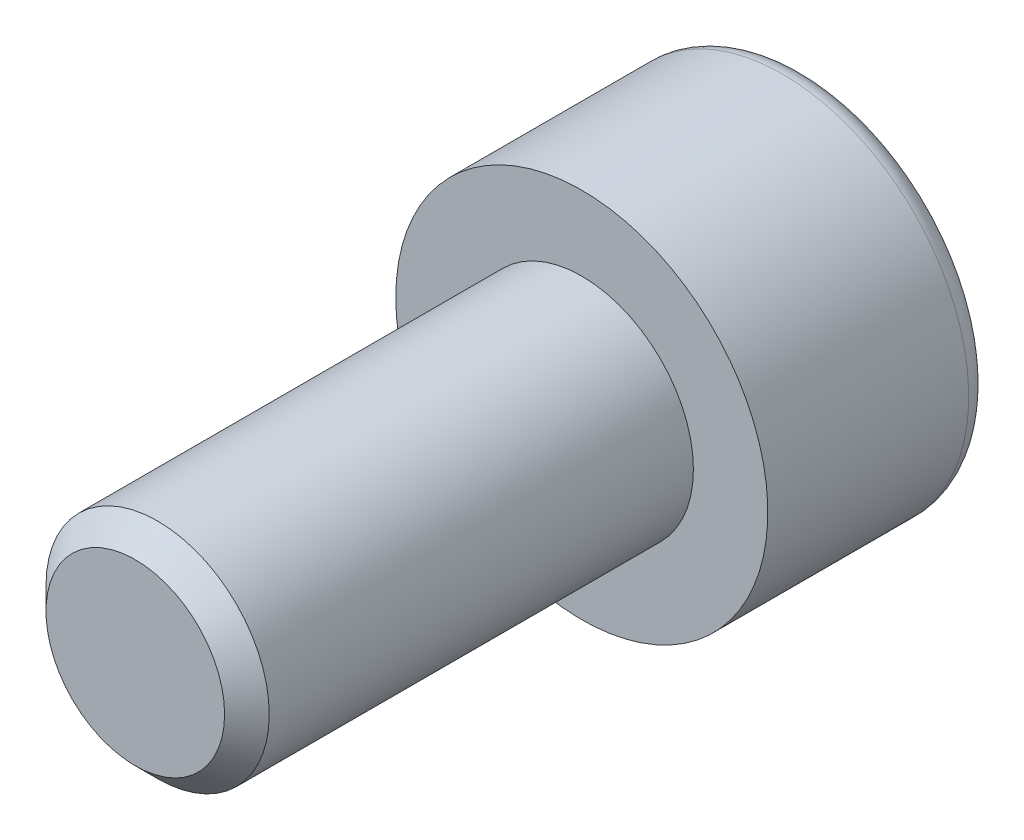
ISO-10303-21;
HEADER;
FILE_DESCRIPTION(('STEP AP214'),'2;1');
FILE_NAME('part.step','',(''),(''),'','','');
FILE_SCHEMA(('AUTOMOTIVE_DESIGN { 1 0 10303 214 1 1 1 1 }'));
ENDSEC;
DATA;
#1=APPLICATION_CONTEXT('core data for automotive mechanical design processes');
#2=APPLICATION_PROTOCOL_DEFINITION('international standard','automotive_design',2000,#1);
#3=PRODUCT_CONTEXT('',#1,'mechanical');
#4=PRODUCT('Part','Part','',(#3));
#5=PRODUCT_RELATED_PRODUCT_CATEGORY('part','',(#4));
#6=PRODUCT_DEFINITION_FORMATION('','',#4);
#7=PRODUCT_DEFINITION_CONTEXT('part definition',#1,'design');
#8=PRODUCT_DEFINITION('design','',#6,#7);
#9=PRODUCT_DEFINITION_SHAPE('','',#8);
#10=(LENGTH_UNIT() NAMED_UNIT(*) SI_UNIT(.MILLI.,.METRE.));
#11=(NAMED_UNIT(*) PLANE_ANGLE_UNIT() SI_UNIT($,.RADIAN.));
#12=(NAMED_UNIT(*) SI_UNIT($,.STERADIAN.) SOLID_ANGLE_UNIT());
#13=UNCERTAINTY_MEASURE_WITH_UNIT(LENGTH_MEASURE(1.E-05),#10,'distance_accuracy_value','');
#14=(GEOMETRIC_REPRESENTATION_CONTEXT(3) GLOBAL_UNCERTAINTY_ASSIGNED_CONTEXT((#13)) GLOBAL_UNIT_ASSIGNED_CONTEXT((#10,
#11,#12)) REPRESENTATION_CONTEXT('',''));
#15=CARTESIAN_POINT('',(0.,0.,0.));
#16=DIRECTION('',(0.,0.,1.));
#17=DIRECTION('',(1.,0.,0.));
#18=AXIS2_PLACEMENT_3D('',#15,#16,#17);
#19=CARTESIAN_POINT('',(0.,0.,-6.));
#20=DIRECTION('',(0.,0.,1.));
#21=DIRECTION('',(1.,0.,0.));
#22=AXIS2_PLACEMENT_3D('',#19,#20,#21);
#23=PLANE('',#22);
#24=CARTESIAN_POINT('',(0.,0.,-6.));
#25=DIRECTION('',(0.,0.,-1.));
#26=DIRECTION('',(-1.,0.,0.));
#27=AXIS2_PLACEMENT_3D('',#24,#25,#26);
#28=CIRCLE('',#27,4.4);
#29=CARTESIAN_POINT('',(-4.4,0.,-6.));
#30=VERTEX_POINT('',#29);
#31=EDGE_CURVE('E141',#30,#30,#28,.T.);
#32=ORIENTED_EDGE('',*,*,#31,.T.);
#33=EDGE_LOOP('',(#32));
#34=FACE_BOUND('',#33,.T.);
#35=DIRECTION('',(-0.86602540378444,0.499999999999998,0.));
#36=VECTOR('',#35,1.);
#37=CARTESIAN_POINT('',(0.,2.88675134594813,-6.));
#38=LINE('',#37,#36);
#39=CARTESIAN_POINT('',(2.5,1.44337567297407,-6.));
#40=VERTEX_POINT('',#39);
#41=CARTESIAN_POINT('',(0.,2.88675134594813,-6.));
#42=VERTEX_POINT('',#41);
#43=EDGE_CURVE('E45',#40,#42,#38,.T.);
#44=ORIENTED_EDGE('',*,*,#43,.T.);
#45=DIRECTION('',(-0.866025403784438,-0.500000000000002,0.));
#46=VECTOR('',#45,1.);
#47=CARTESIAN_POINT('',(0.,2.88675134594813,-6.));
#48=LINE('',#47,#46);
#49=CARTESIAN_POINT('',(-2.5,1.44337567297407,-6.));
#50=VERTEX_POINT('',#49);
#51=EDGE_CURVE('E85',#42,#50,#48,.T.);
#52=ORIENTED_EDGE('',*,*,#51,.T.);
#53=DIRECTION('',(0.,-1.,0.));
#54=VECTOR('',#53,1.);
#55=CARTESIAN_POINT('',(-2.5,-1.44337567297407,-6.));
#56=LINE('',#55,#54);
#57=CARTESIAN_POINT('',(-2.5,-1.44337567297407,-6.));
#58=VERTEX_POINT('',#57);
#59=EDGE_CURVE('E93',#50,#58,#56,.T.);
#60=ORIENTED_EDGE('',*,*,#59,.T.);
#61=DIRECTION('',(0.866025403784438,-0.500000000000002,0.));
#62=VECTOR('',#61,1.);
#63=CARTESIAN_POINT('',(0.,-2.88675134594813,-6.));
#64=LINE('',#63,#62);
#65=CARTESIAN_POINT('',(0.,-2.88675134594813,-6.));
#66=VERTEX_POINT('',#65);
#67=EDGE_CURVE('E111',#58,#66,#64,.T.);
#68=ORIENTED_EDGE('',*,*,#67,.T.);
#69=DIRECTION('',(0.86602540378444,0.499999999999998,0.));
#70=VECTOR('',#69,1.);
#71=CARTESIAN_POINT('',(0.,-2.88675134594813,-6.));
#72=LINE('',#71,#70);
#73=CARTESIAN_POINT('',(2.5,-1.44337567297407,-6.));
#74=VERTEX_POINT('',#73);
#75=EDGE_CURVE('E114',#66,#74,#72,.T.);
#76=ORIENTED_EDGE('',*,*,#75,.T.);
#77=DIRECTION('',(0.,1.,0.));
#78=VECTOR('',#77,1.);
#79=CARTESIAN_POINT('',(2.5,-1.44337567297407,-6.));
#80=LINE('',#79,#78);
#81=EDGE_CURVE('E104',#74,#40,#80,.T.);
#82=ORIENTED_EDGE('',*,*,#81,.T.);
#83=EDGE_LOOP('',(#44,#52,#60,#68,#76,#82));
#84=FACE_BOUND('',#83,.T.);
#85=ADVANCED_FACE('F31',(#34,#84),#23,.F.);
#86=CARTESIAN_POINT('',(0.,0.,-5.4));
#87=DIRECTION('',(0.,0.,-1.));
#88=DIRECTION('',(-1.,0.,0.));
#89=AXIS2_PLACEMENT_3D('',#86,#87,#88);
#90=TOROIDAL_SURFACE('',#89,4.4,0.600000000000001);
#91=ORIENTED_EDGE('',*,*,#31,.F.);
#92=EDGE_LOOP('',(#91));
#93=FACE_BOUND('',#92,.T.);
#94=CARTESIAN_POINT('',(0.,0.,-5.4));
#95=DIRECTION('',(0.,0.,-1.));
#96=DIRECTION('',(-1.,0.,0.));
#97=AXIS2_PLACEMENT_3D('',#94,#95,#96);
#98=CIRCLE('',#97,5.);
#99=CARTESIAN_POINT('',(-5.,0.,-5.4));
#100=VERTEX_POINT('',#99);
#101=EDGE_CURVE('E138',#100,#100,#98,.T.);
#102=ORIENTED_EDGE('',*,*,#101,.T.);
#103=EDGE_LOOP('',(#102));
#104=FACE_BOUND('',#103,.T.);
#105=ADVANCED_FACE('F160',(#93,#104),#90,.T.);
#106=CARTESIAN_POINT('',(0.,0.,0.));
#107=DIRECTION('',(0.,0.,-1.));
#108=DIRECTION('',(-1.,0.,0.));
#109=AXIS2_PLACEMENT_3D('',#106,#107,#108);
#110=CYLINDRICAL_SURFACE('',#109,5.);
#111=ORIENTED_EDGE('',*,*,#101,.F.);
#112=EDGE_LOOP('',(#111));
#113=FACE_BOUND('',#112,.T.);
#114=CARTESIAN_POINT('',(0.,0.,0.));
#115=DIRECTION('',(0.,0.,-1.));
#116=DIRECTION('',(-1.,0.,0.));
#117=AXIS2_PLACEMENT_3D('',#114,#115,#116);
#118=CIRCLE('',#117,5.);
#119=CARTESIAN_POINT('',(-5.,0.,0.));
#120=VERTEX_POINT('',#119);
#121=EDGE_CURVE('E99',#120,#120,#118,.T.);
#122=ORIENTED_EDGE('',*,*,#121,.T.);
#123=EDGE_LOOP('',(#122));
#124=FACE_BOUND('',#123,.T.);
#125=ADVANCED_FACE('F165',(#113,#124),#110,.T.);
#126=CARTESIAN_POINT('',(0.,0.,0.));
#127=DIRECTION('',(0.,0.,-1.));
#128=DIRECTION('',(-1.,0.,0.));
#129=AXIS2_PLACEMENT_3D('',#126,#127,#128);
#130=PLANE('',#129);
#131=CARTESIAN_POINT('',(0.,0.,0.));
#132=DIRECTION('',(0.,0.,1.));
#133=DIRECTION('',(1.,0.,0.));
#134=AXIS2_PLACEMENT_3D('',#131,#132,#133);
#135=CIRCLE('',#134,3.);
#136=CARTESIAN_POINT('',(3.,0.,0.));
#137=VERTEX_POINT('',#136);
#138=EDGE_CURVE('E105',#137,#137,#135,.T.);
#139=ORIENTED_EDGE('',*,*,#138,.F.);
#140=EDGE_LOOP('',(#139));
#141=FACE_BOUND('',#140,.T.);
#142=ORIENTED_EDGE('',*,*,#121,.F.);
#143=EDGE_LOOP('',(#142));
#144=FACE_BOUND('',#143,.T.);
#145=ADVANCED_FACE('F173',(#141,#144),#130,.F.);
#146=CARTESIAN_POINT('',(0.,2.88675134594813,-3.));
#147=DIRECTION('',(-0.499999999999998,-0.86602540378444,0.));
#148=DIRECTION('',(0.86602540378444,-0.499999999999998,0.));
#149=AXIS2_PLACEMENT_3D('',#146,#147,#148);
#150=PLANE('',#149);
#151=ORIENTED_EDGE('',*,*,#43,.F.);
#152=DIRECTION('',(0.,0.,-1.));
#153=VECTOR('',#152,1.);
#154=CARTESIAN_POINT('',(2.5,1.44337567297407,-3.));
#155=LINE('',#154,#153);
#156=CARTESIAN_POINT('',(2.5,1.44337567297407,-3.));
#157=VERTEX_POINT('',#156);
#158=EDGE_CURVE('E127',#157,#40,#155,.T.);
#159=ORIENTED_EDGE('',*,*,#158,.F.);
#160=DIRECTION('',(-0.86602540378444,0.499999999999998,0.));
#161=VECTOR('',#160,1.);
#162=CARTESIAN_POINT('',(0.,2.88675134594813,-3.));
#163=LINE('',#162,#161);
#164=CARTESIAN_POINT('',(0.,2.88675134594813,-3.));
#165=VERTEX_POINT('',#164);
#166=EDGE_CURVE('E98',#157,#165,#163,.T.);
#167=ORIENTED_EDGE('',*,*,#166,.T.);
#168=DIRECTION('',(0.,0.,-1.));
#169=VECTOR('',#168,1.);
#170=CARTESIAN_POINT('',(0.,2.88675134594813,-3.));
#171=LINE('',#170,#169);
#172=EDGE_CURVE('E87',#165,#42,#171,.T.);
#173=ORIENTED_EDGE('',*,*,#172,.T.);
#174=EDGE_LOOP('',(#151,#159,#167,#173));
#175=FACE_BOUND('',#174,.T.);
#176=ADVANCED_FACE('F96',(#175),#150,.T.);
#177=CARTESIAN_POINT('',(0.,2.88675134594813,-3.));
#178=DIRECTION('',(0.500000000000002,-0.866025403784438,0.));
#179=DIRECTION('',(0.866025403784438,0.500000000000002,0.));
#180=AXIS2_PLACEMENT_3D('',#177,#178,#179);
#181=PLANE('',#180);
#182=ORIENTED_EDGE('',*,*,#51,.F.);
#183=ORIENTED_EDGE('',*,*,#172,.F.);
#184=DIRECTION('',(-0.866025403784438,-0.500000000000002,0.));
#185=VECTOR('',#184,1.);
#186=CARTESIAN_POINT('',(0.,2.88675134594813,-3.));
#187=LINE('',#186,#185);
#188=CARTESIAN_POINT('',(-2.5,1.44337567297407,-3.));
#189=VERTEX_POINT('',#188);
#190=EDGE_CURVE('E118',#165,#189,#187,.T.);
#191=ORIENTED_EDGE('',*,*,#190,.T.);
#192=DIRECTION('',(0.,0.,-1.));
#193=VECTOR('',#192,1.);
#194=CARTESIAN_POINT('',(-2.5,1.44337567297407,-3.));
#195=LINE('',#194,#193);
#196=EDGE_CURVE('E89',#189,#50,#195,.T.);
#197=ORIENTED_EDGE('',*,*,#196,.T.);
#198=EDGE_LOOP('',(#182,#183,#191,#197));
#199=FACE_BOUND('',#198,.T.);
#200=ADVANCED_FACE('F86',(#199),#181,.T.);
#201=CARTESIAN_POINT('',(-2.5,-1.44337567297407,-3.));
#202=DIRECTION('',(1.,0.,0.));
#203=DIRECTION('',(0.,0.,-1.));
#204=AXIS2_PLACEMENT_3D('',#201,#202,#203);
#205=PLANE('',#204);
#206=ORIENTED_EDGE('',*,*,#59,.F.);
#207=ORIENTED_EDGE('',*,*,#196,.F.);
#208=DIRECTION('',(0.,-1.,0.));
#209=VECTOR('',#208,1.);
#210=CARTESIAN_POINT('',(-2.5,-1.44337567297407,-3.));
#211=LINE('',#210,#209);
#212=CARTESIAN_POINT('',(-2.5,-1.44337567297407,-3.));
#213=VERTEX_POINT('',#212);
#214=EDGE_CURVE('E120',#189,#213,#211,.T.);
#215=ORIENTED_EDGE('',*,*,#214,.T.);
#216=DIRECTION('',(0.,0.,-1.));
#217=VECTOR('',#216,1.);
#218=CARTESIAN_POINT('',(-2.5,-1.44337567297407,-3.));
#219=LINE('',#218,#217);
#220=EDGE_CURVE('E133',#213,#58,#219,.T.);
#221=ORIENTED_EDGE('',*,*,#220,.T.);
#222=EDGE_LOOP('',(#206,#207,#215,#221));
#223=FACE_BOUND('',#222,.T.);
#224=ADVANCED_FACE('F188',(#223),#205,.T.);
#225=CARTESIAN_POINT('',(0.,-2.88675134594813,-3.));
#226=DIRECTION('',(0.500000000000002,0.866025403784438,0.));
#227=DIRECTION('',(-0.866025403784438,0.500000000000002,0.));
#228=AXIS2_PLACEMENT_3D('',#225,#226,#227);
#229=PLANE('',#228);
#230=ORIENTED_EDGE('',*,*,#67,.F.);
#231=ORIENTED_EDGE('',*,*,#220,.F.);
#232=DIRECTION('',(0.866025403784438,-0.500000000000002,0.));
#233=VECTOR('',#232,1.);
#234=CARTESIAN_POINT('',(0.,-2.88675134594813,-3.));
#235=LINE('',#234,#233);
#236=CARTESIAN_POINT('',(0.,-2.88675134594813,-3.));
#237=VERTEX_POINT('',#236);
#238=EDGE_CURVE('E122',#213,#237,#235,.T.);
#239=ORIENTED_EDGE('',*,*,#238,.T.);
#240=DIRECTION('',(0.,0.,-1.));
#241=VECTOR('',#240,1.);
#242=CARTESIAN_POINT('',(0.,-2.88675134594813,-3.));
#243=LINE('',#242,#241);
#244=EDGE_CURVE('E131',#237,#66,#243,.T.);
#245=ORIENTED_EDGE('',*,*,#244,.T.);
#246=EDGE_LOOP('',(#230,#231,#239,#245));
#247=FACE_BOUND('',#246,.T.);
#248=ADVANCED_FACE('F191',(#247),#229,.T.);
#249=CARTESIAN_POINT('',(0.,-2.88675134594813,-3.));
#250=DIRECTION('',(-0.499999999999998,0.86602540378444,0.));
#251=DIRECTION('',(-0.86602540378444,-0.499999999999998,0.));
#252=AXIS2_PLACEMENT_3D('',#249,#250,#251);
#253=PLANE('',#252);
#254=ORIENTED_EDGE('',*,*,#75,.F.);
#255=ORIENTED_EDGE('',*,*,#244,.F.);
#256=DIRECTION('',(0.86602540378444,0.499999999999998,0.));
#257=VECTOR('',#256,1.);
#258=CARTESIAN_POINT('',(0.,-2.88675134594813,-3.));
#259=LINE('',#258,#257);
#260=CARTESIAN_POINT('',(2.5,-1.44337567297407,-3.));
#261=VERTEX_POINT('',#260);
#262=EDGE_CURVE('E124',#237,#261,#259,.T.);
#263=ORIENTED_EDGE('',*,*,#262,.T.);
#264=DIRECTION('',(0.,0.,-1.));
#265=VECTOR('',#264,1.);
#266=CARTESIAN_POINT('',(2.5,-1.44337567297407,-3.));
#267=LINE('',#266,#265);
#268=EDGE_CURVE('E129',#261,#74,#267,.T.);
#269=ORIENTED_EDGE('',*,*,#268,.T.);
#270=EDGE_LOOP('',(#254,#255,#263,#269));
#271=FACE_BOUND('',#270,.T.);
#272=ADVANCED_FACE('F195',(#271),#253,.T.);
#273=CARTESIAN_POINT('',(2.5,-1.44337567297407,-3.));
#274=DIRECTION('',(-1.,0.,0.));
#275=DIRECTION('',(0.,0.,1.));
#276=AXIS2_PLACEMENT_3D('',#273,#274,#275);
#277=PLANE('',#276);
#278=ORIENTED_EDGE('',*,*,#81,.F.);
#279=ORIENTED_EDGE('',*,*,#268,.F.);
#280=DIRECTION('',(0.,1.,0.));
#281=VECTOR('',#280,1.);
#282=CARTESIAN_POINT('',(2.5,-1.44337567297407,-3.));
#283=LINE('',#282,#281);
#284=EDGE_CURVE('E52',#261,#157,#283,.T.);
#285=ORIENTED_EDGE('',*,*,#284,.T.);
#286=ORIENTED_EDGE('',*,*,#158,.T.);
#287=EDGE_LOOP('',(#278,#279,#285,#286));
#288=FACE_BOUND('',#287,.T.);
#289=ADVANCED_FACE('F199',(#288),#277,.T.);
#290=CARTESIAN_POINT('',(2.5,1.44337567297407,-3.));
#291=DIRECTION('',(0.,0.,1.));
#292=DIRECTION('',(1.,0.,0.));
#293=AXIS2_PLACEMENT_3D('',#290,#291,#292);
#294=PLANE('',#293);
#295=ORIENTED_EDGE('',*,*,#166,.F.);
#296=ORIENTED_EDGE('',*,*,#284,.F.);
#297=ORIENTED_EDGE('',*,*,#262,.F.);
#298=ORIENTED_EDGE('',*,*,#238,.F.);
#299=ORIENTED_EDGE('',*,*,#214,.F.);
#300=ORIENTED_EDGE('',*,*,#190,.F.);
#301=EDGE_LOOP('',(#295,#296,#297,#298,#299,#300));
#302=FACE_BOUND('',#301,.T.);
#303=ADVANCED_FACE('F203',(#302),#294,.F.);
#304=CARTESIAN_POINT('',(0.,0.,12.));
#305=DIRECTION('',(0.,0.,1.));
#306=DIRECTION('',(1.,0.,0.));
#307=AXIS2_PLACEMENT_3D('',#304,#305,#306);
#308=PLANE('',#307);
#309=CARTESIAN_POINT('',(0.,0.,12.));
#310=DIRECTION('',(0.,0.,1.));
#311=DIRECTION('',(1.,0.,0.));
#312=AXIS2_PLACEMENT_3D('',#309,#310,#311);
#313=CIRCLE('',#312,2.4);
#314=CARTESIAN_POINT('',(2.4,0.,12.));
#315=VERTEX_POINT('',#314);
#316=EDGE_CURVE('E38',#315,#315,#313,.T.);
#317=ORIENTED_EDGE('',*,*,#316,.T.);
#318=EDGE_LOOP('',(#317));
#319=FACE_BOUND('',#318,.T.);
#320=ADVANCED_FACE('F146',(#319),#308,.T.);
#321=CARTESIAN_POINT('',(0.,0.,0.));
#322=DIRECTION('',(0.,0.,1.));
#323=DIRECTION('',(1.,0.,0.));
#324=AXIS2_PLACEMENT_3D('',#321,#322,#323);
#325=CYLINDRICAL_SURFACE('',#324,3.);
#326=CARTESIAN_POINT('',(0.,0.,11.4));
#327=DIRECTION('',(0.,0.,1.));
#328=DIRECTION('',(1.,0.,0.));
#329=AXIS2_PLACEMENT_3D('',#326,#327,#328);
#330=CIRCLE('',#329,3.);
#331=CARTESIAN_POINT('',(3.,0.,11.4));
#332=VERTEX_POINT('',#331);
#333=EDGE_CURVE('E11',#332,#332,#330,.F.);
#334=ORIENTED_EDGE('',*,*,#333,.T.);
#335=EDGE_LOOP('',(#334));
#336=FACE_BOUND('',#335,.T.);
#337=ORIENTED_EDGE('',*,*,#138,.T.);
#338=EDGE_LOOP('',(#337));
#339=FACE_BOUND('',#338,.T.);
#340=ADVANCED_FACE('F150',(#336,#339),#325,.T.);
#341=CARTESIAN_POINT('',(0.,0.,12.));
#342=DIRECTION('',(0.,0.,-1.));
#343=DIRECTION('',(-1.,0.,0.));
#344=AXIS2_PLACEMENT_3D('',#341,#342,#343);
#345=CONICAL_SURFACE('',#344,2.4,0.785398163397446);
#346=ORIENTED_EDGE('',*,*,#333,.F.);
#347=EDGE_LOOP('',(#346));
#348=FACE_BOUND('',#347,.T.);
#349=ORIENTED_EDGE('',*,*,#316,.F.);
#350=EDGE_LOOP('',(#349));
#351=FACE_BOUND('',#350,.T.);
#352=ADVANCED_FACE('F148',(#348,#351),#345,.T.);
#353=CLOSED_SHELL('',(#85,#105,#125,#145,#176,#200,#224,#248,#272,#289,#303,#320,#340,#352));
#354=MANIFOLD_SOLID_BREP('B2',#353);
#355=ADVANCED_BREP_SHAPE_REPRESENTATION('',(#18,#354),#14);
#356=SHAPE_DEFINITION_REPRESENTATION(#9,#355);
ENDSEC;
END-ISO-10303-21;
